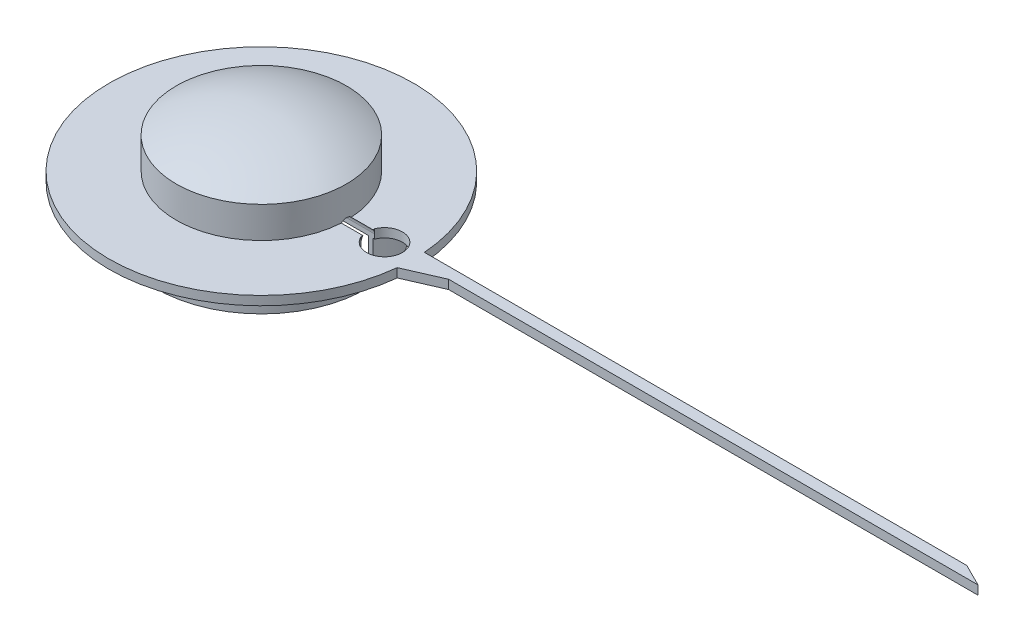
from build123d import *
from build123d.topology import SkipClean

# Parameters (mm, degrees)
SKETCH1_R           = 17
BOSS_EXTRUDE1_DEPTH = 1
CUT_EXTRUDE1_DEPTH  = 1
SKETCH3_R           = 9.5
SKETCH3_R_2         = 8
BOSS_EXTRUDE2_DEPTH = 3
SKETCH4_R           = 9.5
BOSS_EXTRUDE3_DEPTH = 0.5
DOME1_FACE_RADIUS   = 9.5
DOME1_HEIGHT        = 2.5
SKETCH5_R           = 1.5
BOSS_EXTRUDE4_DEPTH = 3
SKETCH8_R           = 11.75
SKETCH8_R_2         = 11.25
BOSS_EXTRUDE6_DEPTH = 4.5
CUT_EXTRUDE3_REACH  = 30.671
BOSS_EXTRUDE5_START = -6.89595
BOSS_EXTRUDE5_DEPTH = 6.89595
BOSS_EXTRUDE7_DEPTH = 1


with BuildPart() as part:
    # Sketch1 → Boss-Extrude1 (new body)
    with BuildSketch(Plane(origin=(0, 0, 0), x_dir=(1, 0, 0), z_dir=(0, 1, 0))):
        with Locations(Location((0, 0, 0), (0, 0, 270))):
            Circle(SKETCH1_R)
    extrude(amount=BOSS_EXTRUDE1_DEPTH)

    # Sketch2 → Cut-Extrude1 (cut)
    with BuildSketch(Plane(origin=(0, 1, 0), x_dir=(1, 0, 0), z_dir=(0, 1, 0))):
        with BuildLine():
            Line((-0.616216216, 1.902702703), (2, 2.75))
            Line((2, 2.75), (5, 2.75))
            Line((5, 2.75), (5, 0.75))
            Line((5, 0.75), (11.895950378, 0.75))
            ThreePointArc((11.895950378, 0.75), (15.75, 0), (11.895950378, -0.75))
            Line((11.895950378, -0.75), (5, -0.75))
            Line((5, -0.75), (5, -2.75))
            Line((5, -2.75), (2, -2.75))
            Line((2, -2.75), (-0.616216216, -1.902702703))
            ThreePointArc((-0.616216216, -1.902702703), (-2, 0), (-0.616216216, 1.902702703))
        make_face()
    extrude(amount=-CUT_EXTRUDE1_DEPTH, mode=Mode.SUBTRACT)

    # Sketch3 → Boss-Extrude2 (add)
    with BuildSketch(Plane(origin=(0, 1, 0), x_dir=(1, 0, 0), z_dir=(0, 1, 0))):
        with Locations(Location((0, 0, 0), (0, 0, 4.528063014))):
            Circle(SKETCH3_R)
        with Locations(Location((0, 0, 0), (0, 0, 5.379378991))):
            Circle(SKETCH3_R_2, mode=Mode.SUBTRACT)
    extrude(amount=BOSS_EXTRUDE2_DEPTH)

    # Sketch4 → Boss-Extrude3 (add)
    with BuildSketch(Plane(origin=(0, 4, 0), x_dir=(1, 0, 0), z_dir=(0, 1, 0))):
        with Locations(Location((0, 0, 0), (0, 0, 4.528063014))):
            Circle(SKETCH4_R)
    extrude(amount=BOSS_EXTRUDE3_DEPTH)

    # Dome1: a dome of height H over a round flat face of radius A is a cap of a sphere of radius (A * A + H * H) / (2 * H)
    dome1_r = (DOME1_FACE_RADIUS * DOME1_FACE_RADIUS + DOME1_HEIGHT * DOME1_HEIGHT) / (2 * DOME1_HEIGHT)
    dome1_base = Plane((0, 4.5, 0), z_dir=(0, 1, 0))
    with Locations(dome1_base.offset(DOME1_HEIGHT - dome1_r)):
        dome1_ball = Sphere(dome1_r, mode=Mode.PRIVATE)
    add(split(dome1_ball, bisect_by=dome1_base, keep=Keep.TOP, mode=Mode.PRIVATE))

    # Sketch5 → Boss-Extrude4 (add)
    with BuildSketch(Plane.XZ.offset(-4)):
        with Locations(Location((0, 0, 0), (0, 0, 90))):
            Circle(SKETCH5_R)
        Polygon((1, 0), (0.5, 0.866025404), (-0.5, 0.866025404), (-1, 0), (-0.5, -0.866025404), (0.5, -0.866025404), align=None, mode=Mode.SUBTRACT)
    extrude(amount=BOSS_EXTRUDE4_DEPTH)

    # Sketch8 → Boss-Extrude6 (add)
    with BuildSketch(Plane.XZ):
        with Locations(Location((0, 0, 0), (0, 0, 3.659665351))):
            Circle(SKETCH8_R)
        with Locations(Location((0, 0, 0), (0, 0, 3.822553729))):
            Circle(SKETCH8_R_2, mode=Mode.SUBTRACT)
    extrude(amount=BOSS_EXTRUDE6_DEPTH)

    # Sketch6 → Cut-Extrude3 (cut, up to next)
    with BuildSketch(Plane.ZY.offset(-5), mode=Mode.PRIVATE) as cut_extrude3_sk1:
        with BuildLine():
            Line((0.75, 0.5), (0.75, -4.5))
            Line((0.75, -4.5), (-0.75, -4.5))
            Line((-0.75, -4.5), (-0.75, 0.5))
            ThreePointArc((-0.75, 0.5), (0, 1.25), (0.75, 0.5))
        make_face()
    cut_extrude3_tool1 = extrude(cut_extrude3_sk1.sketch, amount=-CUT_EXTRUDE3_REACH, mode=Mode.PRIVATE) & part.part
    add(cut_extrude3_tool1.solids().sort_by_distance((5, -1.702969, 0))[0], mode=Mode.SUBTRACT)
    add(cut_extrude3_tool1.solids().sort_by_distance((5, -1.702969, 0))[1], mode=Mode.SUBTRACT)

    # Sketch7 → Boss-Extrude5 (add)
    with SkipClean():  # the faces are left unmerged after this step: merging them gives an invalid solid
        with BuildSketch(Plane.ZY.offset(-5).offset(BOSS_EXTRUDE5_START)):
            with BuildLine():
                Line((-0.75, 1), (-0.75, 0.5))
                ThreePointArc((-0.75, 0.5), (-0.700629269, 0.767616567), (-0.559016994, 1))
                Line((-0.559016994, 1), (-0.75, 1))
            make_face()
            with BuildLine():
                Line((0.75, 0.5), (0.75, 1))
                Line((0.75, 1), (0.559016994, 1))
                ThreePointArc((0.559016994, 1), (0.700629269, 0.767616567), (0.75, 0.5))
            make_face()
        extrude(amount=BOSS_EXTRUDE5_DEPTH)

    # Sketch9 → Boss-Extrude7 (add)
    with SkipClean():  # the faces are left unmerged after this step: merging them gives an invalid solid
        with BuildSketch(Plane.XZ):
            Polygon((20.909686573, -1.25), (16.953981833, -1.25), (16.909686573, 1.75), (20.909686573, 0), (80, 0), (77.5, -1.25), align=None)
        extrude(amount=-BOSS_EXTRUDE7_DEPTH)


solid = part.part
